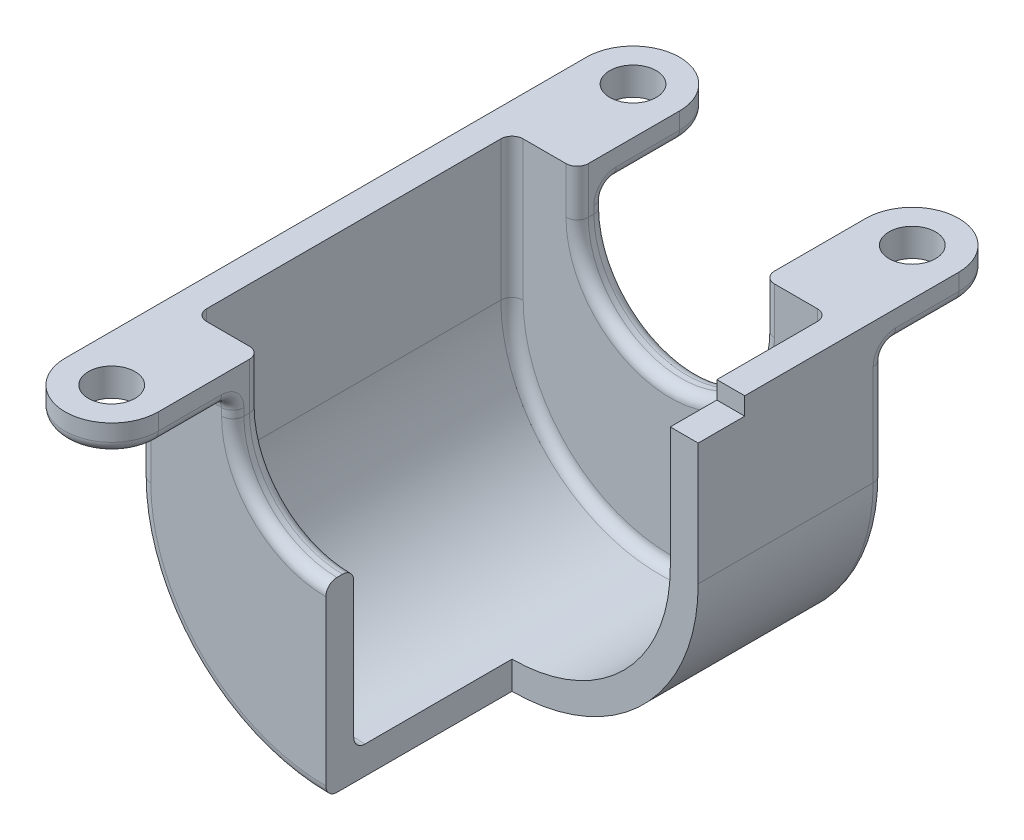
from build123d import *

# Parameters (mm, degrees)
BASE_EXTRUDE_DEPTH      = 50.8
SHELL1_T                = -7.62
BOSS_EXTRUDE1_DEPTH     = 7.62
SKETCH3_R               = 6.35
CUT_EXTRUDE1_DEPTH      = 133.324005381
MIRROR2_COPY_1_DEPTH    = 7.62
MIRROR2_COPY_2_SKETCH_R = 6.35
MIRROR2_COPY_2_DEPTH    = 133.324005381
CUT_EXTRUDE2_REACH      = 143.17
SKETCH4_W               = 25.4
SKETCH4_H               = 4.826
FILLET1_R               = 3.048
FILLET2_R               = 3.048
SKETCH5_W               = 50.8
SKETCH5_H               = 83.82
CUT_EXTRUDE3_DEPTH      = 112.395


with BuildPart() as part:
    # Sketch1 → Base-Extrude (new, symmetric)
    with BuildSketch(Plane.XY):
        with BuildLine():
            Line((-50.8, 0), (-50.8, 38.1))
            Line((-50.8, 38.1), (-25.4, 38.1))
            Line((-25.4, 38.1), (-25.4, 25.4))
            ThreePointArc((-25.4, 25.4), (0, 0), (25.4, 25.4))
            Line((25.4, 25.4), (25.4, 38.1))
            Line((25.4, 38.1), (50.8, 38.1))
            Line((50.8, 38.1), (50.8, 0))
            ThreePointArc((50.8, 0), (0, -50.8), (-50.8, 0))
        make_face()
    extrude(amount=BASE_EXTRUDE_DEPTH, both=True)

    # Shell1
    shell1_openings = [part.faces().sort_by_distance(p)[0] for p in [
        (-38.1, 38.1, 0),
        (-25.4, 31.75, 0),
        (0, 0, 0),
        (25.4, 31.75, 0),
        (38.1, 38.1, 0),
    ]]
    offset(amount=SHELL1_T, openings=shell1_openings, kind=Kind.INTERSECTION)

    # Sketch2 → Boss-Extrude1 (add)
    with BuildSketch(Plane(origin=(0, 38.1, 0), x_dir=(-1, 0, 0), z_dir=(0, 1, 0))):
        with BuildLine():
            Line((50.8, 50.8), (50.8, 71.12))
            ThreePointArc((50.8, 71.12), (38.1, 83.82), (25.4, 71.12))
            Line((25.4, 71.12), (25.4, 50.8))
            Line((25.4, 50.8), (50.8, 50.8))
        make_face()
    boss_extrude1 = extrude(amount=-BOSS_EXTRUDE1_DEPTH)

    # Sketch3 → Cut-Extrude1 (cut, through all)
    with BuildSketch(Plane(origin=(0, 38.1, 0), x_dir=(-1, 0, 0), z_dir=(0, 1, 0))):
        with Locations(Location((38.1, 71.12, 0), (0, 0, 90))):
            Circle(SKETCH3_R)
    cut_extrude1 = extrude(amount=-CUT_EXTRUDE1_DEPTH, mode=Mode.SUBTRACT)

    # Mirror1: Boss-Extrude1, Cut-Extrude1 across plane
    add(boss_extrude1.mirror(Plane(origin=(0, 0, 0), x_dir=(0, 0, 1), z_dir=(1, 0, 0))))
    add(cut_extrude1.mirror(Plane(origin=(0, 0, 0), x_dir=(0, 0, 1), z_dir=(1, 0, 0))), mode=Mode.SUBTRACT)

    # Mirror2: Boss-Extrude1, Cut-Extrude1 across plane
    add(boss_extrude1.mirror(Plane.XY))
    add(cut_extrude1.mirror(Plane.XY), mode=Mode.SUBTRACT)

    # Mirror2 copy 1 sketch → Mirror2 copy 1 (add)
    with BuildSketch(Plane(origin=(0, 38.1, 0), x_dir=(1, 0, 0), z_dir=(0, 1, 0))):
        with BuildLine():
            Line((50.8, 50.8), (50.8, 71.12))
            ThreePointArc((50.8, 71.12), (38.1, 83.82), (25.4, 71.12))
            Line((25.4, 71.12), (25.4, 50.8))
            Line((25.4, 50.8), (50.8, 50.8))
        make_face()
    extrude(amount=-MIRROR2_COPY_1_DEPTH)

    # Mirror2 copy 2 sketch → Mirror2 copy 2 (cut, through all)
    with BuildSketch(Plane(origin=(0, 38.1, 0), x_dir=(1, 0, 0), z_dir=(0, 1, 0))):
        with Locations(Location((38.1, 71.12, 0), (0, 0, 90))):
            Circle(MIRROR2_COPY_2_SKETCH_R)
    extrude(amount=-MIRROR2_COPY_2_DEPTH, mode=Mode.SUBTRACT)

    # Sketch4 → Cut-Extrude2 (cut, up to next)
    with BuildSketch(Plane(origin=(50.8, 0, 0), x_dir=(0, 0, -1), z_dir=(1, 0, 0)), mode=Mode.PRIVATE) as cut_extrude2_sk1:
        with Locations((0, 35.687)):
            Rectangle(SKETCH4_W, SKETCH4_H)
    cut_extrude2_tool1 = extrude(cut_extrude2_sk1.sketch, amount=-CUT_EXTRUDE2_REACH, mode=Mode.PRIVATE) & part.part
    add(cut_extrude2_tool1.solids().sort_by_distance((50.8, 35.687, 0))[0], mode=Mode.SUBTRACT)

    # Fillet1
    fillet1_edges = [part.edges().sort_by_distance(p)[0] for p in [
        (-38.1, 30.48, -50.8),
        (-38.1, 30.48, 50.8),
        (38.1, 30.48, 50.8),
        (38.1, 30.48, -50.8),
    ]]
    fillet(fillet1_edges, radius=FILLET1_R)

    # Fillet2
    fillet2_edges = [part.edges().sort_by_distance(p)[0] for p in [
        (-38.1, 30.48, -83.82),
        (-25.4, 30.48, -62.484),
        (-50.8, 30.48, -62.484),
        (25.4, 26.416, -50.8),
        (-50.8, 13.716, -50.8),
        (50.8, 30.48, -62.484),
        (50.8, 30.48, 62.484),
        (25.4, 26.416, 50.8),
        (-50.8, 13.716, 50.8),
        (-50.8, 30.48, 62.484),
        (-50.8, 29.587261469, -51.692738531),
        (-25.4, 29.587261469, -51.692738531),
        (50.8, 29.587261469, -51.692738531),
        (25.4, 29.587261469, -51.692738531),
        (50.8, 29.587261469, 51.692738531),
        (25.4, 29.587261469, 51.692738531),
        (-50.8, 29.587261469, 51.692738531),
        (-25.4, 29.587261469, 51.692738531),
        (0, 0, 50.8),
        (-25.4, 26.416, 50.8),
        (0, -43.18, -43.18),
        (43.18, 19.05, -43.18),
        (25.4, 31.75, -43.18),
        (0, 0, -43.18),
        (-25.4, 31.75, -43.18),
        (-43.18, 19.05, -43.18),
        (0, -43.18, 43.18),
        (43.18, 19.05, 43.18),
        (25.4, 31.75, 43.18),
        (0, 0, 43.18),
        (-25.4, 31.75, 43.18),
        (-43.18, 19.05, 43.18),
        (0, -50.8, 50.8),
        (-25.4, 30.48, 62.484),
        (-38.1, 30.48, 83.82),
        (38.1, 30.48, 83.82),
        (25.4, 30.48, 62.484),
        (50.8, 13.716, 50.8),
        (-25.4, 26.416, -50.8),
        (0, 0, -50.8),
        (25.4, 30.48, -62.484),
        (38.1, 30.48, -83.82),
        (50.8, 13.716, -50.8),
        (0, -50.8, -50.8),
    ]]
    fillet(fillet2_edges, radius=FILLET2_R)

    # Sketch5 → Cut-Extrude3 (cut)
    with BuildSketch(Plane(origin=(0, 38.1, 0), x_dir=(-1, 0, 0), z_dir=(0, 1, 0))):
        with Locations((-25.4, 41.91)):
            Rectangle(SKETCH5_W, SKETCH5_H)
    extrude(amount=-CUT_EXTRUDE3_DEPTH, mode=Mode.SUBTRACT)


solid = part.part
